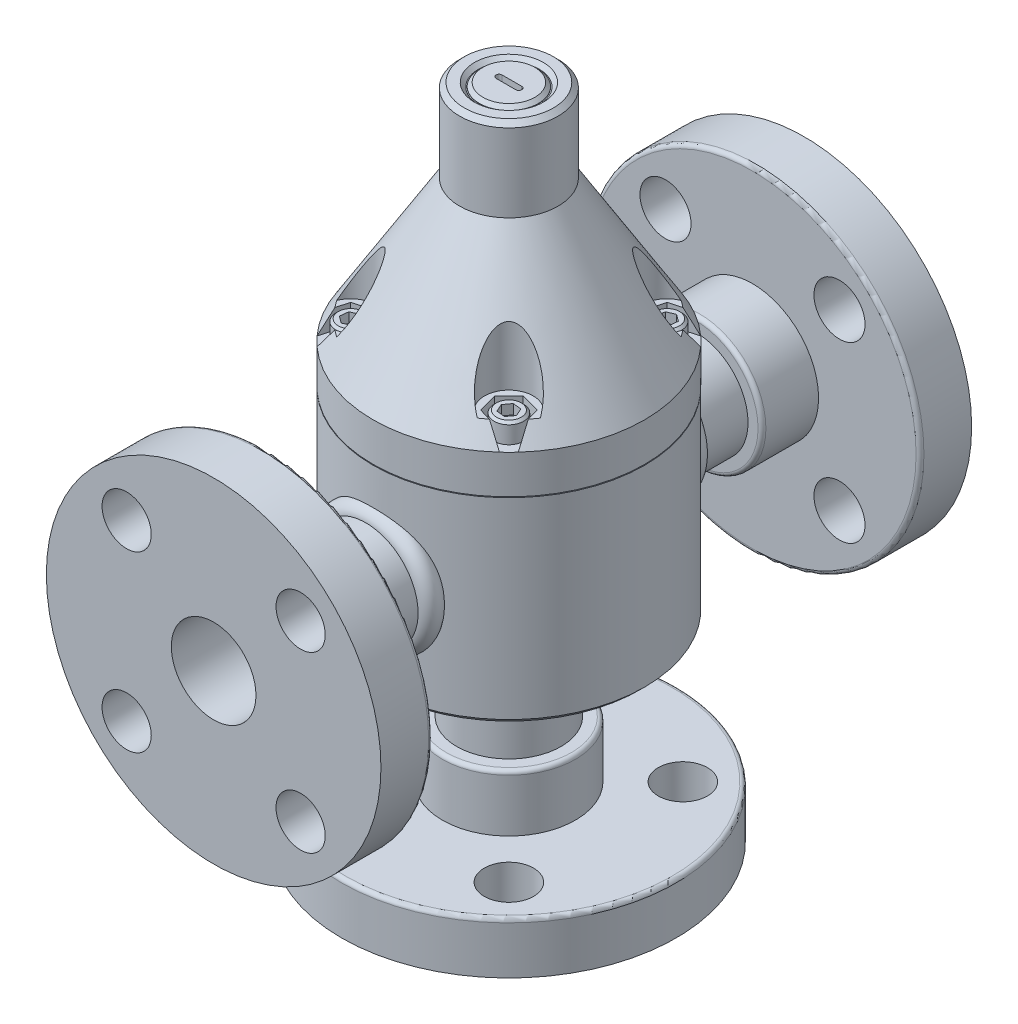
from build123d import *

# Parameters (mm, degrees)
SKETCH1_R                = 43.815
EXTRUDE1_DEPTH           = 148.59
CHAMFER1_SIZE            = 1.524
SKETCH3_R                = 11.1125
EXTRUDE2_DEPTH           = 1.27
EXTRUDE2_DRAFT           = -45
SKETCH4_R                = 9.525
EXTRUDE3_DEPTH           = 1.27
CHAMFER2_SIZE            = 1.143
EXTRUDE4_DEPTH           = 3.175
EXTRUDE4_DRAFT           = -1
SKETCH6_R                = 7.874
EXTRUDE5_DEPTH           = 22.86
EXTRUDE6_DEPTH           = 6.35
SKETCH8_R                = 4.7625
EXTRUDE7_DEPTH           = 6.35
EXTRUDE8_DEPTH           = 3.175
CIRPATTERN1_COUNT        = 4
CHAMFER3_SIZE            = 0.762
SKETCH10_R               = 53.975
BOSS_EXTRUDE1_DEPTH      = 16.6624
SKETCH11_R               = 21.4249
BOSS_EXTRUDE2_DEPTH      = 34.925
BOSS_EXTRUDE3_REACH      = 212.55
BOSS_EXTRUDE3_END_RADIUS = 43.815
SKETCH12_R               = 16.8275
SKETCH13_R               = 7.9375
CUT_EXTRUDE1_DEPTH       = 34.925
CIRPATTERN3_COUNT        = 4
SKETCH14_R               = 13.6525
CUT_EXTRUDE2_DEPTH       = 25.4
SKETCH15_R               = 54.046799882
BOSS_EXTRUDE4_DEPTH      = 16.6624
SKETCH16_R               = 21.323190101
BOSS_EXTRUDE5_DEPTH      = 34.925
BOSS_EXTRUDE6_REACH      = 249.569
BOSS_EXTRUDE6_END_RADIUS = 43.815
SKETCH17_R               = 16.8275
SKETCH18_R               = 8.236892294
CUT_EXTRUDE3_DEPTH       = 34.925
CIRPATTERN4_COUNT        = 4
FILLET1_R                = 1.27
SKETCH20_R               = 53.975
BOSS_EXTRUDE7_DEPTH      = 16.6624
SKETCH21_R               = 21.463
BOSS_EXTRUDE8_DEPTH      = 34.925
SKETCH22_R               = 16.8275
BOSS_EXTRUDE9_DEPTH      = 63.5
FILLET2_R                = 1.27
SKETCH23_R               = 13.6525
CUT_EXTRUDE4_DEPTH       = 25.4
SKETCH24_R               = 7.9375
CUT_EXTRUDE5_DEPTH       = 25.4
CIRPATTERN5_COUNT        = 4


with BuildPart() as part:
    # Sketch1 → Extrude1 (new body)
    with BuildSketch(Plane(origin=(0, 0, 0), x_dir=(1, 0, 0), z_dir=(0, 1, 0))):
        with Locations(Location((0, 0, 0), (0, 0, 270))):
            Circle(SKETCH1_R)
    extrude(amount=EXTRUDE1_DEPTH)

    # Sketch2 → Cut-Revolve1 (revolve, cut)
    with BuildSketch(Plane.XY, mode=Mode.PRIVATE) as cut_revolve1_sk:
        Polygon((-52.628834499, 63.5), (-30.226, 63.5), (-30.226, 63.754), (-43.815, 63.754), (-43.815, 76.2), (-15.875, 121.92), (-15.875, 152.4), (-52.628834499, 152.4), align=None)
    revolve(cut_revolve1_sk.sketch.rotate(Axis((0, 148.59, 0), (0, -1, 0)), 270), axis=Axis((0, 148.59, 0), (0, -1, 0)), mode=Mode.SUBTRACT)

    # Chamfer1
    chamfer1_edges = [part.edges().sort_by_distance(p)[0] for p in [
        (0, 0, -43.815),
        (0, 148.59, -15.875),
    ]]
    chamfer(chamfer1_edges, length=CHAMFER1_SIZE)


with BuildPart() as extrude2_tool:
    # Sketch3 → Extrude2 (with draft: the straight prism first)
    with BuildSketch(Plane(origin=(0, 148.59, 0), x_dir=(-1, 0, 0), z_dir=(0, 1, 0))):
        Circle(SKETCH3_R)
    extrude(amount=-EXTRUDE2_DEPTH)
    # Extrude2: the draft: its side faces are tilted about the plane it starts from
    extrude2_sides = [extrude2_tool.faces().sort_by_distance(p)[0] for p in [
        (11.1125, 147.955, 0),
    ]]
    draft(extrude2_sides, Plane(origin=(0, 148.59, 0), x_dir=(-1, 0, 0), z_dir=(0, 1, 0)), EXTRUDE2_DRAFT)


with BuildPart() as part_1:
    add(part.part)

    # Extrude2: cut by extrude2_tool
    add(extrude2_tool.part, mode=Mode.SUBTRACT)

    # Sketch4 → Extrude3 (add)
    with BuildSketch(Plane(origin=(0, 148.59, 0), x_dir=(-1, 0, 0), z_dir=(0, 1, 0))):
        with Locations(Location((0, 0, 0), (0, 0, 90))):
            Circle(SKETCH4_R)
    extrude(amount=-EXTRUDE3_DEPTH)

    # Chamfer2
    chamfer2_edges = [part_1.edges().sort_by_distance(p)[0] for p in [
        (0, 148.59, -9.525),
    ]]
    chamfer(chamfer2_edges, length=CHAMFER2_SIZE)


with BuildPart() as extrude4_tool:
    # Sketch5 → Extrude4 (with draft: the straight prism first)
    with BuildSketch(Plane(origin=(0, 148.59, 0), x_dir=(-1, 0, 0), z_dir=(0, 1, 0))):
        with BuildLine():
            Line((3.175, 0.9652), (-3.175, 0.9652))
            ThreePointArc((-3.175, 0.9652), (-4.1402, 0), (-3.175, -0.9652))
            Line((-3.175, -0.9652), (3.175, -0.9652))
            ThreePointArc((3.175, -0.9652), (4.1402, 0), (3.175, 0.9652))
        make_face()
    extrude(amount=-EXTRUDE4_DEPTH)
    # Extrude4: the draft: its side faces are tilted about the plane it starts from
    extrude4_sides = [extrude4_tool.faces().sort_by_distance(p)[0] for p in [
        (0, 147.0025, 0.9652),
        (4.1402, 147.0025, 0),
        (0, 147.0025, -0.9652),
        (-4.1402, 147.0025, 0),
    ]]
    draft(extrude4_sides, Plane(origin=(0, 148.59, 0), x_dir=(-1, 0, 0), z_dir=(0, 1, 0)), EXTRUDE4_DRAFT)


with BuildPart() as part_2:
    add(part_1.part)

    # Extrude4: cut by extrude4_tool
    add(extrude4_tool.part, mode=Mode.SUBTRACT)

    # Sketch6 → Extrude5 (cut)
    with BuildSketch(Plane(origin=(0, 82.55, 0), x_dir=(-1, 0, 0), z_dir=(0, 1, 0))):
        with Locations((-25.521887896, 25.521887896)):
            Circle(SKETCH6_R)
    extrude5 = extrude(amount=EXTRUDE5_DEPTH, mode=Mode.SUBTRACT)

    # Sketch7 → Extrude6 (cut)
    with BuildSketch(Plane(origin=(0, 82.55, 0), x_dir=(-1, 0, 0), z_dir=(0, 1, 0))):
        Polygon((-30.08447079, 20.959305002), (-23.85186665, 19.289283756), (-19.289283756, 23.85186665), (-20.959305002, 30.08447079), (-33.653634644, 33.653634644), align=None)
    extrude6 = extrude(amount=-EXTRUDE6_DEPTH, mode=Mode.SUBTRACT)

    # Sketch8 → Extrude7 (add)
    with BuildSketch(Plane(origin=(0, 82.55, 0), x_dir=(-1, 0, 0), z_dir=(0, 1, 0))):
        with Locations(Location((-25.521887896, 25.521887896, 0), (0, 0, 90))):
            Circle(SKETCH8_R)
    extrude7 = extrude(amount=-EXTRUDE7_DEPTH)

    # Sketch9 → Extrude8 (cut)
    with BuildSketch(Plane(origin=(0, 82.55, 0), x_dir=(-1, 0, 0), z_dir=(0, 1, 0))):
        Polygon((-23.873856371, 27.745151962), (-26.623275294, 28.060757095), (-28.271306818, 25.83749303), (-27.169919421, 23.298623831), (-24.420500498, 22.983018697), (-22.772468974, 25.206282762), align=None)
    extrude8 = extrude(amount=-EXTRUDE8_DEPTH, mode=Mode.SUBTRACT)

    # CirPattern1: Extrude5, Extrude6, Extrude7, Extrude8 ×4 about axis
    cirpattern1_axis = Axis((0, 0, 0), (0, 1, 0))
    add([extrude5.rotate(cirpattern1_axis, i * 360 / CIRPATTERN1_COUNT) for i in range(1, CIRPATTERN1_COUNT)], mode=Mode.SUBTRACT)
    add([extrude6.rotate(cirpattern1_axis, i * 360 / CIRPATTERN1_COUNT) for i in range(1, CIRPATTERN1_COUNT)], mode=Mode.SUBTRACT)
    add([extrude7.rotate(cirpattern1_axis, i * 360 / CIRPATTERN1_COUNT) for i in range(1, CIRPATTERN1_COUNT)])
    add([extrude8.rotate(cirpattern1_axis, i * 360 / CIRPATTERN1_COUNT) for i in range(1, CIRPATTERN1_COUNT)], mode=Mode.SUBTRACT)

    # Chamfer3
    chamfer3_edges = [part_2.edges().sort_by_distance(p)[0] for p in [
        (-20.759387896, 82.55, 25.521887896),
        (-25.521887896, 82.55, -20.759387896),
        (20.759387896, 82.55, -25.521887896),
        (25.521887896, 82.55, 20.759387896),
    ]]
    chamfer(chamfer3_edges, length=CHAMFER3_SIZE)



with BuildPart() as body_2:
    # Sketch10 → Boss-Extrude1 (new body)
    with BuildSketch(Plane.XY.offset(95.25)):
        with Locations((0, 31.75)):
            Circle(SKETCH10_R)
    extrude(amount=-BOSS_EXTRUDE1_DEPTH)

    # Sketch11 → Boss-Extrude2 (add)
    with BuildSketch(Plane.XY.offset(95.25)):
        with Locations((0, 31.75)):
            Circle(SKETCH11_R)
    extrude(amount=-BOSS_EXTRUDE2_DEPTH)


with BuildPart() as part_3:
    add(part_2.part)

    add(body_2.part)  # Boss-Extrude3 merges body 2
    # Boss-Extrude3: up to this cylinder (the profile starts outside it)
    boss_extrude3_end = Plane(origin=(0, 31.75, 0), z_dir=(0, -1, 0)) * Cylinder(BOSS_EXTRUDE3_END_RADIUS, 513.73, mode=Mode.PRIVATE)
    # Sketch12 → Boss-Extrude3 (add, up to the surface)
    with BuildSketch(Plane.XY.offset(95.25), mode=Mode.PRIVATE) as boss_extrude3_sk1:
        with Locations((0, 31.75)):
            Circle(SKETCH12_R)
    boss_extrude3_tool1 = extrude(boss_extrude3_sk1.sketch, amount=-BOSS_EXTRUDE3_REACH, mode=Mode.PRIVATE) - boss_extrude3_end
    add(boss_extrude3_tool1.solids().sort_by_distance((0, 31.75, 95.25))[0])

    # Sketch13 → Cut-Extrude1 (cut)
    with BuildSketch(Plane.XY.offset(95.25)):
        with Locations((-28.063300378, 59.813300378)):
            Circle(SKETCH13_R)
    cut_extrude1 = extrude(amount=-CUT_EXTRUDE1_DEPTH, mode=Mode.SUBTRACT)

    # CirPattern3: Cut-Extrude1 ×4 about axis
    cirpattern3_axis = Axis((0, 31.75, 0), (0, 0, 1))
    for i in range(1, CIRPATTERN3_COUNT):
        add(cut_extrude1.rotate(cirpattern3_axis, i * 360 / CIRPATTERN3_COUNT), mode=Mode.SUBTRACT)

    # Sketch14 → Cut-Extrude2 (cut)
    with BuildSketch(Plane.XY.offset(95.25)):
        with Locations((0, 31.75)):
            Circle(SKETCH14_R)
    extrude(amount=-CUT_EXTRUDE2_DEPTH, mode=Mode.SUBTRACT)



with BuildPart() as body_2_2:
    # Sketch15 → Boss-Extrude4 (new body)
    with BuildSketch(Plane.XY.offset(-95.25)):
        with Locations((0, 31.75)):
            Circle(SKETCH15_R)
    extrude(amount=BOSS_EXTRUDE4_DEPTH)

    # Sketch16 → Boss-Extrude5 (add)
    with BuildSketch(Plane.XY.offset(-95.25)):
        with Locations((0, 31.75)):
            Circle(SKETCH16_R)
    extrude(amount=BOSS_EXTRUDE5_DEPTH)


with BuildPart() as part_4:
    add(part_3.part)

    add(body_2_2.part)  # Boss-Extrude6 merges body 2 2
    # Boss-Extrude6: up to this cylinder (the profile starts outside it)
    boss_extrude6_end = Plane(origin=(0, 31.75, 0), z_dir=(0, -1, 0)) * Cylinder(BOSS_EXTRUDE6_END_RADIUS, 587.768, mode=Mode.PRIVATE)
    # Sketch17 → Boss-Extrude6 (add, up to the surface)
    with BuildSketch(Plane.XY.offset(-95.25), mode=Mode.PRIVATE) as boss_extrude6_sk1:
        with Locations((0, 31.75)):
            Circle(SKETCH17_R)
    boss_extrude6_tool1 = extrude(boss_extrude6_sk1.sketch, amount=BOSS_EXTRUDE6_REACH, mode=Mode.PRIVATE) - boss_extrude6_end
    add(boss_extrude6_tool1.solids().sort_by_distance((0, 31.75, -95.25))[0])

    # Sketch18 → Cut-Extrude3 (cut)
    with BuildSketch(Plane.XY.offset(-95.25)):
        with Locations((28.063300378, 59.813300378)):
            Circle(SKETCH18_R)
    cut_extrude3 = extrude(amount=CUT_EXTRUDE3_DEPTH, mode=Mode.SUBTRACT)

    # CirPattern4: Cut-Extrude3 ×4 about axis
    cirpattern4_axis = Axis((0, 31.75, 0), (0, 0, 1))
    for i in range(1, CIRPATTERN4_COUNT):
        add(cut_extrude3.rotate(cirpattern4_axis, i * 360 / CIRPATTERN4_COUNT), mode=Mode.SUBTRACT)

    # Fillet1
    fillet1_edges = [part_4.edges().sort_by_distance(p)[0] for p in [
        (-53.975, 31.75, 78.5876),
        (-21.4249, 31.75, 60.325),
        (-21.323190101, 31.75, -60.325),
        (-54.046799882, 31.75, -78.5876),
    ]]
    fillet(fillet1_edges, radius=FILLET1_R)

    # Sketch19 → Revolve1 (revolve)
    with BuildSketch(Plane(origin=(0, 0, 0), x_dir=(0, 0, -1), z_dir=(1, 0, 0)), mode=Mode.PRIVATE) as revolve1_sk:
        with BuildLine():
            Line((-46.147022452, 46.327866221), (-46.147022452, 48.210883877))
            ThreePointArc((-46.147022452, 48.210883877), (-42.587276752, 51.938056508), (-38.700543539, 48.553250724))
            Line((-38.700543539, 48.553250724), (-38.700543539, 44.273665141))
            Line((-38.700543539, 44.273665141), (-46.147022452, 46.327866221))
        make_face()
    revolve1 = revolve(revolve1_sk.sketch.rotate(Axis((0, 31.843927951, 59.363719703), (0, 0, -1)), 229.501992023), axis=Axis((0, 31.843927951, 59.363719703), (0, 0, -1)))

    # Mirror2: Revolve1 across plane
    add(revolve1.mirror(Plane.XY))



with BuildPart() as body_2_3:
    # Sketch20 → Boss-Extrude7 (new body)
    with BuildSketch(Plane(origin=(0, -63.5, 0), x_dir=(1, 0, 0), z_dir=(0, 1, 0))):
        with Locations(Location((0, 0, 0), (0, 0, 270))):
            Circle(SKETCH20_R)
    extrude(amount=BOSS_EXTRUDE7_DEPTH)

    # Sketch21 → Boss-Extrude8 (add)
    with BuildSketch(Plane(origin=(0, -63.5, 0), x_dir=(1, 0, 0), z_dir=(0, 1, 0))):
        with Locations(Location((0, 0, 0), (0, 0, 270))):
            Circle(SKETCH21_R)
    extrude(amount=BOSS_EXTRUDE8_DEPTH)


with BuildPart() as part_5:
    add(part_4.part)

    add(body_2_3.part)  # Boss-Extrude9 merges body 2 3
    # Sketch22 → Boss-Extrude9 (add)
    with BuildSketch(Plane(origin=(0, -63.5, 0), x_dir=(1, 0, 0), z_dir=(0, 1, 0))):
        with Locations(Location((0, 0, 0), (0, 0, 270))):
            Circle(SKETCH22_R)
    extrude(amount=BOSS_EXTRUDE9_DEPTH)

    # Fillet2
    fillet2_edges = [part_5.edges().sort_by_distance(p)[0] for p in [
        (0, -28.575, -21.463),
        (0, -46.8376, -53.975),
    ]]
    fillet(fillet2_edges, radius=FILLET2_R)

    # Sketch23 → Cut-Extrude4 (cut)
    with BuildSketch(Plane(origin=(0, -63.5, 0), x_dir=(1, 0, 0), z_dir=(0, 1, 0))):
        with Locations(Location((0, 0, 0), (0, 0, 270))):
            Circle(SKETCH23_R)
    extrude(amount=CUT_EXTRUDE4_DEPTH, mode=Mode.SUBTRACT)

    # Sketch24 → Cut-Extrude5 (cut)
    with BuildSketch(Plane(origin=(0, -63.5, 0), x_dir=(1, 0, 0), z_dir=(0, 1, 0))):
        with Locations(Location((-28.063300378, -28.063300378, 0), (0, 0, 270))):
            Circle(SKETCH24_R)
    cut_extrude5 = extrude(amount=CUT_EXTRUDE5_DEPTH, mode=Mode.SUBTRACT)

    # CirPattern5: Cut-Extrude5 ×4 about axis
    cirpattern5_axis = Axis((0, 0, 0), (0, 1, 0))
    for i in range(1, CIRPATTERN5_COUNT):
        add(cut_extrude5.rotate(cirpattern5_axis, i * 360 / CIRPATTERN5_COUNT), mode=Mode.SUBTRACT)

    # Sketch25 → Revolve2 (revolve)
    with BuildSketch(Plane(origin=(0, 0, 0), x_dir=(0, 0, -1), z_dir=(1, 0, 0)), mode=Mode.PRIVATE) as revolve2_sk:
        with BuildLine():
            Line((-20.0025, 1.700413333), (-20.0025, 4.88818359))
            Line((-20.0025, 4.88818359), (-14.145034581, 4.88818359))
            Line((-14.145034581, 4.88818359), (-14.145034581, -3.175))
            ThreePointArc((-14.145034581, -3.175), (-18.268119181, -2.172222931), (-20.0025, 1.700413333))
        make_face()
    revolve(revolve2_sk.sketch.rotate(Axis((0, 0, 0), (0, -1, 0)), 145.387559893), axis=Axis((0, 0, 0), (0, -1, 0)))


solid = part_5.part
